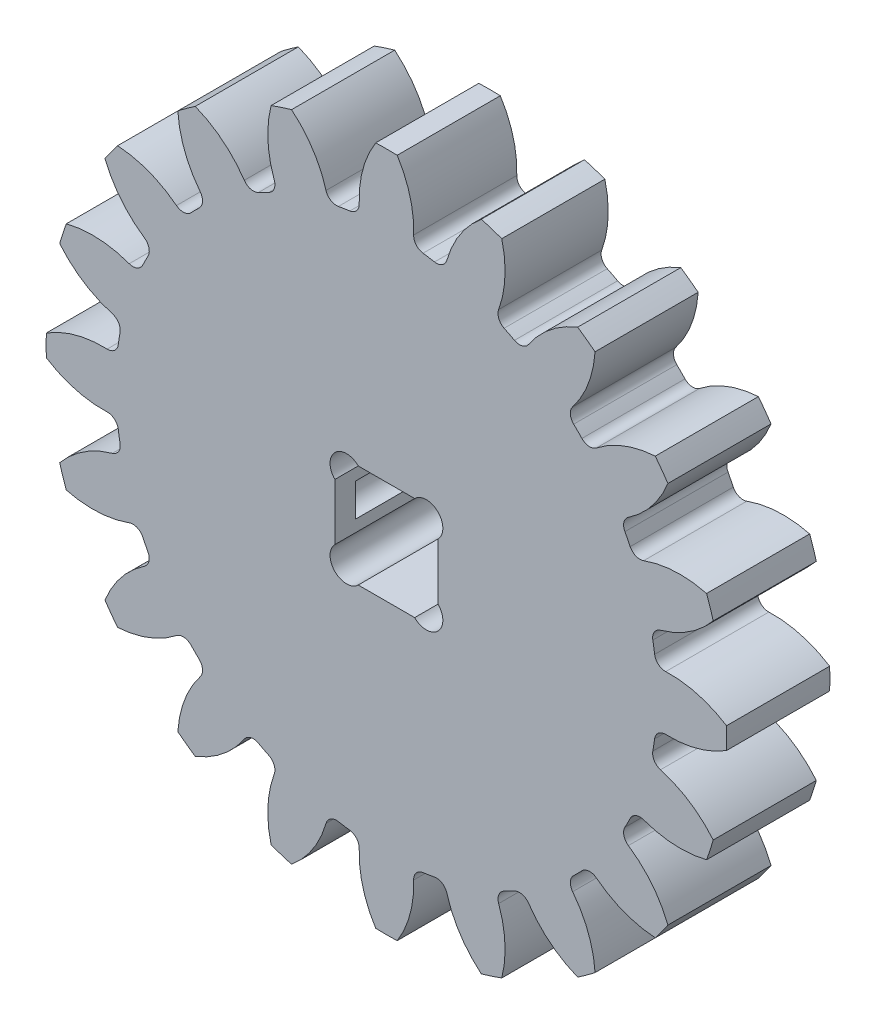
from build123d import *

# Parameters (mm, degrees)
BOSS_EXTRU_1_DEPTH                 = 10
CONG_1_R                           = 1.05
R_P_TITION_CIRCULAIRE4_COUNT       = 20
CONG_1_OF_R_P_TITION_CIRCULAIRE4_R = 1.05
ENL_V_MAT_EXTRU_1_DEPTH            = 50.073340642
ESQUISSE6_R                        = 1.6
ENL_V_MAT_EXTRU_2_DEPTH            = 8


with BuildPart() as part:
    # Esquisse3 → Boss.-Extru.1 (new body)
    with BuildSketch(Plane.XY):
        with BuildLine():
            Line((-5.48511162, 25.366466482), (-1.378706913, -0.560352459))
            Line((-1.378706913, -0.560352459), (2.727697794, 25.366466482))
            ThreePointArc((2.727697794, 25.366466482), (1.956271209, 25.476936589), (1.181905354, 25.564458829))
            ThreePointArc((1.181905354, 25.564458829), (1.026243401, 29.1274489), (-0.336560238, 32.423187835))
            ThreePointArc((-0.336560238, 32.423187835), (-1.378706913, 32.439647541), (-2.420853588, 32.423187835))
            ThreePointArc((-2.420853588, 32.423187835), (-3.783657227, 29.1274489), (-3.93931918, 25.564458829))
            ThreePointArc((-3.93931918, 25.564458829), (-4.713685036, 25.476936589), (-5.48511162, 25.366466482))
        make_face()
    boss_extru_1 = extrude(amount=BOSS_EXTRU_1_DEPTH)

    # Cong_1
    cong_1_edges = [part.edges().sort_by_distance(p)[0] for p in [
        (-3.93931918, 25.564458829, 5),
        (1.181905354, 25.564458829, 5),
    ]]
    fillet(cong_1_edges, radius=CONG_1_R)

    # R_p_tition circulaire4: Boss.-Extru.1 ×20 about axis
    r_p_tition_circulaire4_axis = Axis((-1.378706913, -0.560352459, 0), (0, 0, 1))
    for i in range(1, R_P_TITION_CIRCULAIRE4_COUNT):
        add(boss_extru_1.rotate(r_p_tition_circulaire4_axis, i * 360 / R_P_TITION_CIRCULAIRE4_COUNT))

    # Cong_1 of R_p_tition circulaire4
    cong_1_of_r_p_tition_circulaire4_edges = [part.edges().sort_by_distance(p)[0] for p in [
        (-11.887004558, 23.494546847, 5),
        (-7.016430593, 25.07709226, 5),
        (-18.806064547, 19.06997372, 5),
        (-14.662906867, 22.080153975, 5),
        (-24.019213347, 12.723847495, 5),
        (-21.009033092, 16.867005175, 5),
        (-27.016151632, 5.077371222, 5),
        (-25.433606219, 9.947945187, 5),
        (-27.503518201, -3.120964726, 5),
        (-27.503518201, 2.000259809, 5),
        (-25.433606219, -11.068650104, 5),
        (-27.016151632, -6.198076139, 5),
        (-21.009033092, -17.987710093, 5),
        (-24.019213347, -13.844552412, 5),
        (-14.662906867, -23.200858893, 5),
        (-18.806064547, -20.190678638, 5),
        (-7.016430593, -26.197797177, 5),
        (-11.887004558, -24.615251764, 5),
        (1.181905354, -26.685163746, 5),
        (-3.93931918, -26.685163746, 5),
        (9.129590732, -24.615251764, 5),
        (4.259016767, -26.197797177, 5),
        (16.048650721, -20.190678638, 5),
        (11.90549304, -23.200858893, 5),
        (21.261799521, -13.844552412, 5),
        (18.251619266, -17.987710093, 5),
        (24.258737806, -6.198076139, 5),
        (22.676192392, -11.068650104, 5),
        (24.746104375, 2.000259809, 5),
        (24.746104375, -3.120964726, 5),
        (22.676192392, 9.947945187, 5),
        (24.258737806, 5.077371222, 5),
        (18.251619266, 16.867005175, 5),
        (21.261799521, 12.723847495, 5),
        (11.90549304, 22.080153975, 5),
        (16.048650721, 19.06997372, 5),
        (4.259016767, 25.07709226, 5),
        (9.129590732, 23.494546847, 5),
    ]]
    fillet(cong_1_of_r_p_tition_circulaire4_edges, radius=CONG_1_OF_R_P_TITION_CIRCULAIRE4_R)

    # Esquisse5 → Enl_v. mat.-Extru.1 (cut, through all)
    with BuildSketch(Plane.XY.offset(10)):
        with BuildLine():
            Line((-4.115965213, 4.439647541), (1.358551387, 4.439647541))
            ThreePointArc((1.358551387, 4.439647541), (3.621293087, 4.439647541), (3.621293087, 2.176905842))
            Line((3.621293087, 2.176905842), (3.621293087, -3.297610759))
            ThreePointArc((3.621293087, -3.297610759), (3.621293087, -5.560352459), (1.358551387, -5.560352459))
            Line((1.358551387, -5.560352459), (-4.115965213, -5.560352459))
            ThreePointArc((-4.115965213, -5.560352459), (-6.378706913, -5.560352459), (-6.378706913, -3.297610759))
            Line((-6.378706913, -3.297610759), (-6.378706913, 2.176905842))
            ThreePointArc((-6.378706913, 2.176905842), (-6.378706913, 4.439647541), (-4.115965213, 4.439647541))
        make_face()
    extrude(amount=-ENL_V_MAT_EXTRU_1_DEPTH, mode=Mode.SUBTRACT)

    # Esquisse6 → Enl_v. mat.-Extru.2 (cut)
    with BuildSketch(Plane(origin=(0, 0, 0), x_dir=(-1, 0, 0), z_dir=(0, 0, -1))):
        with Locations((-3.621293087, -0.560352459)):
            Circle(ESQUISSE6_R)
        with Locations((6.425164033, -0.560352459)):
            Circle(ESQUISSE6_R)
    extrude(amount=-ENL_V_MAT_EXTRU_2_DEPTH, mode=Mode.SUBTRACT)


solid = part.part
